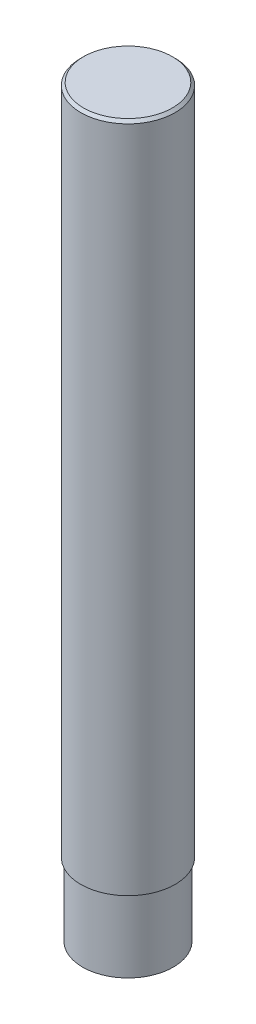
from build123d import *


with BuildPart() as part:
    # Esquisse1 → R_volution1 (revolve)
    with BuildSketch(Plane(origin=(0, 0, 0), x_dir=(0, 0, -1), z_dir=(1, 0, 0)), mode=Mode.PRIVATE) as r_volution1_sk:
        Polygon((5, 0), (5, -8), (0, -8), (0, 74), (4.9, 74), (5.2, 73.7), (5.2, 0), align=None)
    revolve(r_volution1_sk.sketch.rotate(Axis((0, 41.076967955, 0), (0, -1, 0)), 180), axis=Axis((0, 41.076967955, 0), (0, -1, 0)))


solid = part.part
